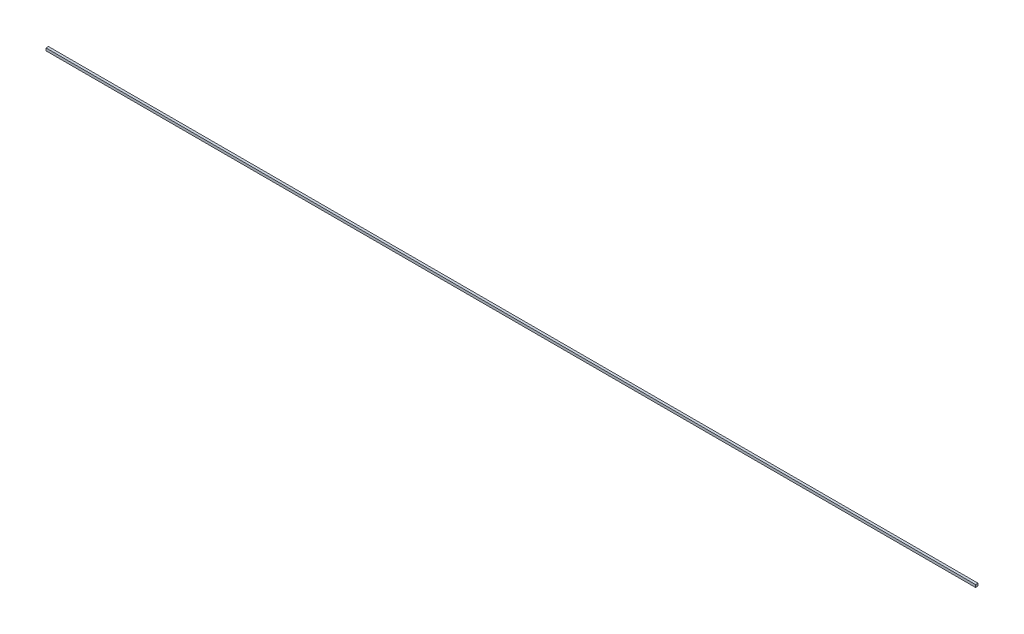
ISO-10303-21;
HEADER;
FILE_DESCRIPTION(('STEP AP214'),'2;1');
FILE_NAME('part.step','',(''),(''),'','','');
FILE_SCHEMA(('AUTOMOTIVE_DESIGN { 1 0 10303 214 1 1 1 1 }'));
ENDSEC;
DATA;
#1=APPLICATION_CONTEXT('core data for automotive mechanical design processes');
#2=APPLICATION_PROTOCOL_DEFINITION('international standard','automotive_design',2000,#1);
#3=PRODUCT_CONTEXT('',#1,'mechanical');
#4=PRODUCT('Part','Part','',(#3));
#5=PRODUCT_RELATED_PRODUCT_CATEGORY('part','',(#4));
#6=PRODUCT_DEFINITION_FORMATION('','',#4);
#7=PRODUCT_DEFINITION_CONTEXT('part definition',#1,'design');
#8=PRODUCT_DEFINITION('design','',#6,#7);
#9=PRODUCT_DEFINITION_SHAPE('','',#8);
#10=(LENGTH_UNIT() NAMED_UNIT(*) SI_UNIT(.MILLI.,.METRE.));
#11=(NAMED_UNIT(*) PLANE_ANGLE_UNIT() SI_UNIT($,.RADIAN.));
#12=(NAMED_UNIT(*) SI_UNIT($,.STERADIAN.) SOLID_ANGLE_UNIT());
#13=UNCERTAINTY_MEASURE_WITH_UNIT(LENGTH_MEASURE(1.E-05),#10,'distance_accuracy_value','');
#14=(GEOMETRIC_REPRESENTATION_CONTEXT(3) GLOBAL_UNCERTAINTY_ASSIGNED_CONTEXT((#13)) GLOBAL_UNIT_ASSIGNED_CONTEXT((#10,
#11,#12)) REPRESENTATION_CONTEXT('',''));
#15=CARTESIAN_POINT('',(0.,0.,0.));
#16=DIRECTION('',(0.,0.,1.));
#17=DIRECTION('',(1.,0.,0.));
#18=AXIS2_PLACEMENT_3D('',#15,#16,#17);
#19=CARTESIAN_POINT('',(113.203,0.,-0.3));
#20=DIRECTION('',(0.,0.,1.));
#21=DIRECTION('',(0.,-1.,0.));
#22=AXIS2_PLACEMENT_3D('',#19,#20,#21);
#23=PLANE('',#22);
#24=DIRECTION('',(0.,1.,0.));
#25=VECTOR('',#24,1.);
#26=CARTESIAN_POINT('',(-113.203,0.,-0.3));
#27=LINE('',#26,#25);
#28=CARTESIAN_POINT('',(-113.203,0.,-0.3));
#29=VERTEX_POINT('',#28);
#30=CARTESIAN_POINT('',(-113.203,0.62,-0.3));
#31=VERTEX_POINT('',#30);
#32=EDGE_CURVE('E93',#29,#31,#27,.T.);
#33=ORIENTED_EDGE('',*,*,#32,.T.);
#34=DIRECTION('',(-1.,0.,0.));
#35=VECTOR('',#34,1.);
#36=CARTESIAN_POINT('',(113.203,0.62,-0.3));
#37=LINE('',#36,#35);
#38=CARTESIAN_POINT('',(113.203,0.62,-0.3));
#39=VERTEX_POINT('',#38);
#40=EDGE_CURVE('E11',#39,#31,#37,.T.);
#41=ORIENTED_EDGE('',*,*,#40,.F.);
#42=DIRECTION('',(0.,1.,0.));
#43=VECTOR('',#42,1.);
#44=CARTESIAN_POINT('',(113.203,0.,-0.3));
#45=LINE('',#44,#43);
#46=CARTESIAN_POINT('',(113.203,0.,-0.3));
#47=VERTEX_POINT('',#46);
#48=EDGE_CURVE('E81',#47,#39,#45,.T.);
#49=ORIENTED_EDGE('',*,*,#48,.F.);
#50=DIRECTION('',(-1.,0.,0.));
#51=VECTOR('',#50,1.);
#52=CARTESIAN_POINT('',(113.203,0.,-0.3));
#53=LINE('',#52,#51);
#54=EDGE_CURVE('E89',#47,#29,#53,.T.);
#55=ORIENTED_EDGE('',*,*,#54,.T.);
#56=EDGE_LOOP('',(#33,#41,#49,#55));
#57=FACE_BOUND('',#56,.T.);
#58=ADVANCED_FACE('F30',(#57),#23,.F.);
#59=CARTESIAN_POINT('',(113.203,0.62,-0.3));
#60=DIRECTION('',(0.,-1.,0.));
#61=DIRECTION('',(0.,0.,-1.));
#62=AXIS2_PLACEMENT_3D('',#59,#60,#61);
#63=PLANE('',#62);
#64=DIRECTION('',(0.,0.,1.));
#65=VECTOR('',#64,1.);
#66=CARTESIAN_POINT('',(-113.203,0.62,-0.3));
#67=LINE('',#66,#65);
#68=CARTESIAN_POINT('',(-113.203,0.62,0.3));
#69=VERTEX_POINT('',#68);
#70=EDGE_CURVE('E85',#31,#69,#67,.T.);
#71=ORIENTED_EDGE('',*,*,#70,.T.);
#72=DIRECTION('',(-1.,0.,0.));
#73=VECTOR('',#72,1.);
#74=CARTESIAN_POINT('',(113.203,0.62,0.3));
#75=LINE('',#74,#73);
#76=CARTESIAN_POINT('',(113.203,0.62,0.3));
#77=VERTEX_POINT('',#76);
#78=EDGE_CURVE('E38',#77,#69,#75,.T.);
#79=ORIENTED_EDGE('',*,*,#78,.F.);
#80=DIRECTION('',(0.,0.,1.));
#81=VECTOR('',#80,1.);
#82=CARTESIAN_POINT('',(113.203,0.62,-0.3));
#83=LINE('',#82,#81);
#84=EDGE_CURVE('E76',#39,#77,#83,.T.);
#85=ORIENTED_EDGE('',*,*,#84,.F.);
#86=ORIENTED_EDGE('',*,*,#40,.T.);
#87=EDGE_LOOP('',(#71,#79,#85,#86));
#88=FACE_BOUND('',#87,.T.);
#89=ADVANCED_FACE('F84',(#88),#63,.F.);
#90=CARTESIAN_POINT('',(113.203,0.,0.3));
#91=DIRECTION('',(0.,0.,-1.));
#92=DIRECTION('',(0.,1.,0.));
#93=AXIS2_PLACEMENT_3D('',#90,#91,#92);
#94=PLANE('',#93);
#95=DIRECTION('',(0.,-1.,0.));
#96=VECTOR('',#95,1.);
#97=CARTESIAN_POINT('',(-113.203,0.,0.3));
#98=LINE('',#97,#96);
#99=CARTESIAN_POINT('',(-113.203,0.,0.3));
#100=VERTEX_POINT('',#99);
#101=EDGE_CURVE('E63',#69,#100,#98,.T.);
#102=ORIENTED_EDGE('',*,*,#101,.T.);
#103=DIRECTION('',(-1.,0.,0.));
#104=VECTOR('',#103,1.);
#105=CARTESIAN_POINT('',(113.203,0.,0.3));
#106=LINE('',#105,#104);
#107=CARTESIAN_POINT('',(113.203,0.,0.3));
#108=VERTEX_POINT('',#107);
#109=EDGE_CURVE('E86',#108,#100,#106,.T.);
#110=ORIENTED_EDGE('',*,*,#109,.F.);
#111=DIRECTION('',(0.,-1.,0.));
#112=VECTOR('',#111,1.);
#113=CARTESIAN_POINT('',(113.203,0.,0.3));
#114=LINE('',#113,#112);
#115=EDGE_CURVE('E79',#77,#108,#114,.T.);
#116=ORIENTED_EDGE('',*,*,#115,.F.);
#117=ORIENTED_EDGE('',*,*,#78,.T.);
#118=EDGE_LOOP('',(#102,#110,#116,#117));
#119=FACE_BOUND('',#118,.T.);
#120=ADVANCED_FACE('F87',(#119),#94,.F.);
#121=CARTESIAN_POINT('',(113.203,0.,-0.3));
#122=DIRECTION('',(0.,1.,0.));
#123=DIRECTION('',(0.,0.,1.));
#124=AXIS2_PLACEMENT_3D('',#121,#122,#123);
#125=PLANE('',#124);
#126=DIRECTION('',(0.,0.,-1.));
#127=VECTOR('',#126,1.);
#128=CARTESIAN_POINT('',(-113.203,0.,-0.3));
#129=LINE('',#128,#127);
#130=EDGE_CURVE('E69',#100,#29,#129,.T.);
#131=ORIENTED_EDGE('',*,*,#130,.T.);
#132=ORIENTED_EDGE('',*,*,#54,.F.);
#133=DIRECTION('',(0.,0.,-1.));
#134=VECTOR('',#133,1.);
#135=CARTESIAN_POINT('',(113.203,0.,-0.3));
#136=LINE('',#135,#134);
#137=EDGE_CURVE('E46',#108,#47,#136,.T.);
#138=ORIENTED_EDGE('',*,*,#137,.F.);
#139=ORIENTED_EDGE('',*,*,#109,.T.);
#140=EDGE_LOOP('',(#131,#132,#138,#139));
#141=FACE_BOUND('',#140,.T.);
#142=ADVANCED_FACE('F100',(#141),#125,.F.);
#143=CARTESIAN_POINT('',(113.203,0.62,-0.3));
#144=DIRECTION('',(1.,0.,0.));
#145=DIRECTION('',(0.,0.,-1.));
#146=AXIS2_PLACEMENT_3D('',#143,#144,#145);
#147=PLANE('',#146);
#148=ORIENTED_EDGE('',*,*,#48,.T.);
#149=ORIENTED_EDGE('',*,*,#84,.T.);
#150=ORIENTED_EDGE('',*,*,#115,.T.);
#151=ORIENTED_EDGE('',*,*,#137,.T.);
#152=EDGE_LOOP('',(#148,#149,#150,#151));
#153=FACE_BOUND('',#152,.T.);
#154=ADVANCED_FACE('F77',(#153),#147,.T.);
#155=CARTESIAN_POINT('',(-113.203,0.62,-0.3));
#156=DIRECTION('',(1.,0.,0.));
#157=DIRECTION('',(0.,0.,-1.));
#158=AXIS2_PLACEMENT_3D('',#155,#156,#157);
#159=PLANE('',#158);
#160=ORIENTED_EDGE('',*,*,#32,.F.);
#161=ORIENTED_EDGE('',*,*,#130,.F.);
#162=ORIENTED_EDGE('',*,*,#101,.F.);
#163=ORIENTED_EDGE('',*,*,#70,.F.);
#164=EDGE_LOOP('',(#160,#161,#162,#163));
#165=FACE_BOUND('',#164,.T.);
#166=ADVANCED_FACE('F103',(#165),#159,.F.);
#167=CLOSED_SHELL('',(#58,#89,#120,#142,#154,#166));
#168=MANIFOLD_SOLID_BREP('B2',#167);
#169=ADVANCED_BREP_SHAPE_REPRESENTATION('',(#18,#168),#14);
#170=SHAPE_DEFINITION_REPRESENTATION(#9,#169);
ENDSEC;
END-ISO-10303-21;
